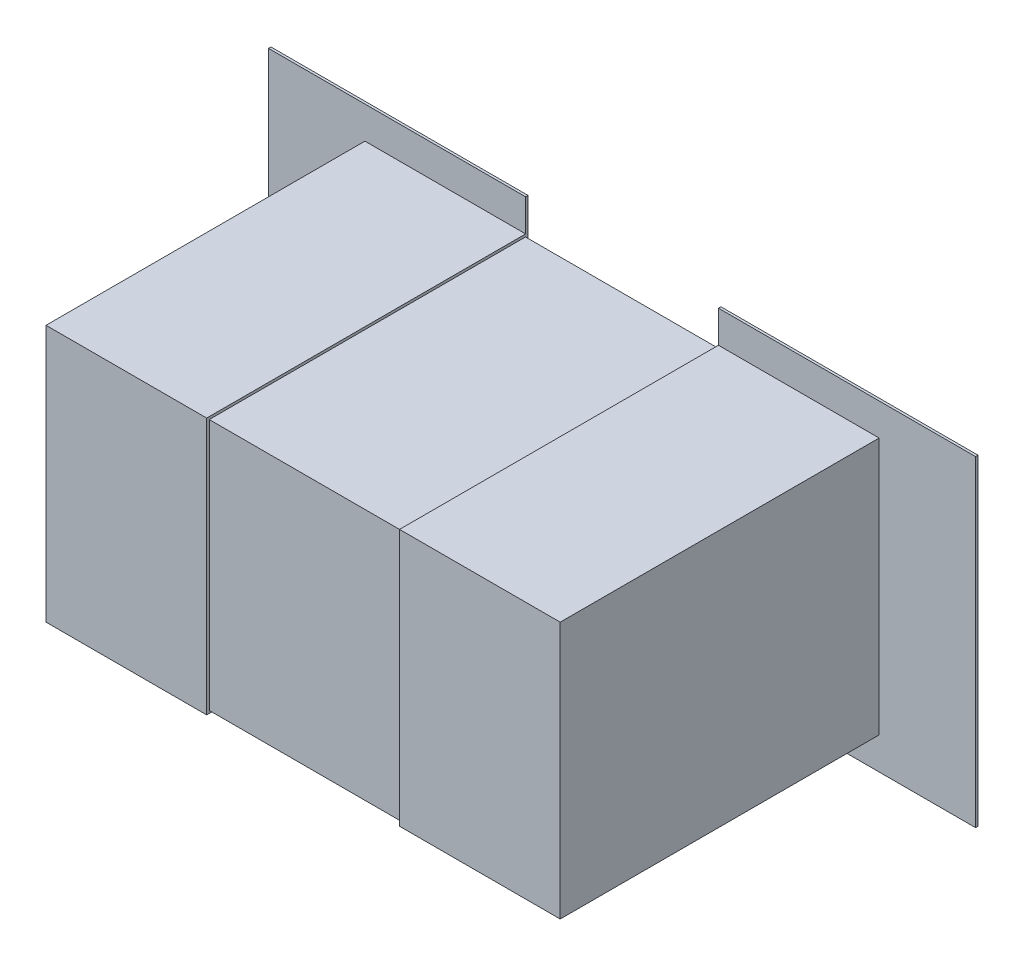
ISO-10303-21;
HEADER;
FILE_DESCRIPTION(('STEP AP214'),'2;1');
FILE_NAME('part.step','',(''),(''),'','','');
FILE_SCHEMA(('AUTOMOTIVE_DESIGN { 1 0 10303 214 1 1 1 1 }'));
ENDSEC;
DATA;
#1=APPLICATION_CONTEXT('core data for automotive mechanical design processes');
#2=APPLICATION_PROTOCOL_DEFINITION('international standard','automotive_design',2000,#1);
#3=PRODUCT_CONTEXT('',#1,'mechanical');
#4=PRODUCT('Part','Part','',(#3));
#5=PRODUCT_RELATED_PRODUCT_CATEGORY('part','',(#4));
#6=PRODUCT_DEFINITION_FORMATION('','',#4);
#7=PRODUCT_DEFINITION_CONTEXT('part definition',#1,'design');
#8=PRODUCT_DEFINITION('design','',#6,#7);
#9=PRODUCT_DEFINITION_SHAPE('','',#8);
#10=(LENGTH_UNIT() NAMED_UNIT(*) SI_UNIT(.MILLI.,.METRE.));
#11=(NAMED_UNIT(*) PLANE_ANGLE_UNIT() SI_UNIT($,.RADIAN.));
#12=(NAMED_UNIT(*) SI_UNIT($,.STERADIAN.) SOLID_ANGLE_UNIT());
#13=UNCERTAINTY_MEASURE_WITH_UNIT(LENGTH_MEASURE(1.E-05),#10,'distance_accuracy_value','');
#14=(GEOMETRIC_REPRESENTATION_CONTEXT(3) GLOBAL_UNCERTAINTY_ASSIGNED_CONTEXT((#13)) GLOBAL_UNIT_ASSIGNED_CONTEXT((#10,
#11,#12)) REPRESENTATION_CONTEXT('',''));
#15=CARTESIAN_POINT('',(0.,0.,0.));
#16=DIRECTION('',(0.,0.,1.));
#17=DIRECTION('',(1.,0.,0.));
#18=AXIS2_PLACEMENT_3D('',#15,#16,#17);
#19=CARTESIAN_POINT('',(0.800000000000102,-0.399999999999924,0.0762));
#20=DIRECTION('',(1.,0.,0.));
#21=DIRECTION('',(0.,0.,-1.));
#22=AXIS2_PLACEMENT_3D('',#19,#20,#21);
#23=PLANE('',#22);
#24=DIRECTION('',(0.,0.,-1.));
#25=VECTOR('',#24,1.);
#26=CARTESIAN_POINT('',(0.800000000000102,-0.399999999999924,0.0762));
#27=LINE('',#26,#25);
#28=CARTESIAN_POINT('',(0.800000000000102,-0.399999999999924,0.08382));
#29=VERTEX_POINT('',#28);
#30=CARTESIAN_POINT('',(0.800000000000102,-0.399999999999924,1.076198));
#31=VERTEX_POINT('',#30);
#32=EDGE_CURVE('E181',#29,#31,#27,.F.);
#33=ORIENTED_EDGE('',*,*,#32,.F.);
#34=DIRECTION('',(0.,1.,0.));
#35=VECTOR('',#34,1.);
#36=CARTESIAN_POINT('',(0.800000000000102,0.,0.08382));
#37=LINE('',#36,#35);
#38=CARTESIAN_POINT('',(0.800000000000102,0.399999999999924,0.08382));
#39=VERTEX_POINT('',#38);
#40=EDGE_CURVE('E191',#39,#29,#37,.F.);
#41=ORIENTED_EDGE('',*,*,#40,.F.);
#42=DIRECTION('',(0.,0.,1.));
#43=VECTOR('',#42,1.);
#44=CARTESIAN_POINT('',(0.800000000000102,0.399999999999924,0.0762));
#45=LINE('',#44,#43);
#46=CARTESIAN_POINT('',(0.800000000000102,0.399999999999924,1.076198));
#47=VERTEX_POINT('',#46);
#48=EDGE_CURVE('E174',#47,#39,#45,.F.);
#49=ORIENTED_EDGE('',*,*,#48,.F.);
#50=DIRECTION('',(0.,1.,0.));
#51=VECTOR('',#50,1.);
#52=CARTESIAN_POINT('',(0.800000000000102,0.,1.076198));
#53=LINE('',#52,#51);
#54=EDGE_CURVE('E149',#31,#47,#53,.T.);
#55=ORIENTED_EDGE('',*,*,#54,.F.);
#56=EDGE_LOOP('',(#33,#41,#49,#55));
#57=FACE_BOUND('',#56,.T.);
#58=ADVANCED_FACE('F16',(#57),#23,.T.);
#59=CARTESIAN_POINT('',(1.09999999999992,-0.500000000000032,0.0762));
#60=DIRECTION('',(1.,0.,0.));
#61=DIRECTION('',(0.,0.,-1.));
#62=AXIS2_PLACEMENT_3D('',#59,#60,#61);
#63=PLANE('',#62);
#64=DIRECTION('',(0.,0.,-1.));
#65=VECTOR('',#64,1.);
#66=CARTESIAN_POINT('',(1.09999999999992,-0.500000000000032,0.0762));
#67=LINE('',#66,#65);
#68=CARTESIAN_POINT('',(1.09999999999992,-0.500000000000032,0.0762));
#69=VERTEX_POINT('',#68);
#70=CARTESIAN_POINT('',(1.09999999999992,-0.500000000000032,0.08382));
#71=VERTEX_POINT('',#70);
#72=EDGE_CURVE('E167',#69,#71,#67,.F.);
#73=ORIENTED_EDGE('',*,*,#72,.F.);
#74=DIRECTION('',(0.,1.,0.));
#75=VECTOR('',#74,1.);
#76=CARTESIAN_POINT('',(1.09999999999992,0.,0.0762));
#77=LINE('',#76,#75);
#78=CARTESIAN_POINT('',(1.09999999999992,0.500000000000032,0.0762));
#79=VERTEX_POINT('',#78);
#80=EDGE_CURVE('E19',#69,#79,#77,.T.);
#81=ORIENTED_EDGE('',*,*,#80,.T.);
#82=DIRECTION('',(0.,0.,1.));
#83=VECTOR('',#82,1.);
#84=CARTESIAN_POINT('',(1.09999999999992,0.500000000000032,0.0762));
#85=LINE('',#84,#83);
#86=CARTESIAN_POINT('',(1.09999999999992,0.500000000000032,0.08382));
#87=VERTEX_POINT('',#86);
#88=EDGE_CURVE('E155',#87,#79,#85,.F.);
#89=ORIENTED_EDGE('',*,*,#88,.F.);
#90=DIRECTION('',(0.,1.,0.));
#91=VECTOR('',#90,1.);
#92=CARTESIAN_POINT('',(1.09999999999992,0.,0.08382));
#93=LINE('',#92,#91);
#94=EDGE_CURVE('E185',#71,#87,#93,.T.);
#95=ORIENTED_EDGE('',*,*,#94,.F.);
#96=EDGE_LOOP('',(#73,#81,#89,#95));
#97=FACE_BOUND('',#96,.T.);
#98=ADVANCED_FACE('F166',(#97),#63,.T.);
#99=CARTESIAN_POINT('',(0.,0.,0.0762));
#100=DIRECTION('',(0.,0.,1.));
#101=DIRECTION('',(1.,0.,0.));
#102=AXIS2_PLACEMENT_3D('',#99,#100,#101);
#103=PLANE('',#102);
#104=ORIENTED_EDGE('',*,*,#80,.F.);
#105=DIRECTION('',(1.,0.,0.));
#106=VECTOR('',#105,1.);
#107=CARTESIAN_POINT('',(0.30000000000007,-0.500000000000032,0.0762));
#108=LINE('',#107,#106);
#109=CARTESIAN_POINT('',(0.30000000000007,-0.500000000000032,0.0762));
#110=VERTEX_POINT('',#109);
#111=EDGE_CURVE('E198',#110,#69,#108,.T.);
#112=ORIENTED_EDGE('',*,*,#111,.F.);
#113=DIRECTION('',(0.,1.,0.));
#114=VECTOR('',#113,1.);
#115=CARTESIAN_POINT('',(0.30000000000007,-0.399999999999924,0.0762));
#116=LINE('',#115,#114);
#117=CARTESIAN_POINT('',(0.30000000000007,0.500000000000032,0.0762));
#118=VERTEX_POINT('',#117);
#119=EDGE_CURVE('E173',#110,#118,#116,.T.);
#120=ORIENTED_EDGE('',*,*,#119,.T.);
#121=DIRECTION('',(1.,0.,0.));
#122=VECTOR('',#121,1.);
#123=CARTESIAN_POINT('',(1.09999999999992,0.500000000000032,0.0762));
#124=LINE('',#123,#122);
#125=EDGE_CURVE('E160',#79,#118,#124,.F.);
#126=ORIENTED_EDGE('',*,*,#125,.F.);
#127=EDGE_LOOP('',(#104,#112,#120,#126));
#128=FACE_BOUND('',#127,.T.);
#129=ADVANCED_FACE('F172',(#128),#103,.F.);
#130=CARTESIAN_POINT('',(1.09999999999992,0.500000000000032,0.0762));
#131=DIRECTION('',(0.,1.,0.));
#132=DIRECTION('',(0.,0.,1.));
#133=AXIS2_PLACEMENT_3D('',#130,#131,#132);
#134=PLANE('',#133);
#135=ORIENTED_EDGE('',*,*,#88,.T.);
#136=ORIENTED_EDGE('',*,*,#125,.T.);
#137=DIRECTION('',(0.,0.,-1.));
#138=VECTOR('',#137,1.);
#139=CARTESIAN_POINT('',(0.30000000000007,0.500000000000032,0.0841999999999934));
#140=LINE('',#139,#138);
#141=CARTESIAN_POINT('',(0.30000000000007,0.500000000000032,0.08382));
#142=VERTEX_POINT('',#141);
#143=EDGE_CURVE('E201',#118,#142,#140,.F.);
#144=ORIENTED_EDGE('',*,*,#143,.T.);
#145=DIRECTION('',(1.,0.,0.));
#146=VECTOR('',#145,1.);
#147=CARTESIAN_POINT('',(0.,0.500000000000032,0.08382));
#148=LINE('',#147,#146);
#149=EDGE_CURVE('E162',#87,#142,#148,.F.);
#150=ORIENTED_EDGE('',*,*,#149,.F.);
#151=EDGE_LOOP('',(#135,#136,#144,#150));
#152=FACE_BOUND('',#151,.T.);
#153=ADVANCED_FACE('F157',(#152),#134,.T.);
#154=CARTESIAN_POINT('',(0.800000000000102,0.399999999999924,0.0762));
#155=DIRECTION('',(0.,1.,0.));
#156=DIRECTION('',(0.,0.,1.));
#157=AXIS2_PLACEMENT_3D('',#154,#155,#156);
#158=PLANE('',#157);
#159=ORIENTED_EDGE('',*,*,#48,.T.);
#160=DIRECTION('',(1.,0.,0.));
#161=VECTOR('',#160,1.);
#162=CARTESIAN_POINT('',(0.,0.399999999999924,0.08382));
#163=LINE('',#162,#161);
#164=CARTESIAN_POINT('',(0.30000000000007,0.399999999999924,0.08382));
#165=VERTEX_POINT('',#164);
#166=EDGE_CURVE('E188',#165,#39,#163,.T.);
#167=ORIENTED_EDGE('',*,*,#166,.F.);
#168=DIRECTION('',(0.,0.,-1.));
#169=VECTOR('',#168,1.);
#170=CARTESIAN_POINT('',(0.30000000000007,0.399999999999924,0.0841999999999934));
#171=LINE('',#170,#169);
#172=CARTESIAN_POINT('',(0.30000000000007,0.399999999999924,1.076198));
#173=VERTEX_POINT('',#172);
#174=EDGE_CURVE('E206',#165,#173,#171,.F.);
#175=ORIENTED_EDGE('',*,*,#174,.T.);
#176=DIRECTION('',(1.,0.,0.));
#177=VECTOR('',#176,1.);
#178=CARTESIAN_POINT('',(0.,0.399999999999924,1.076198));
#179=LINE('',#178,#177);
#180=EDGE_CURVE('E179',#47,#173,#179,.F.);
#181=ORIENTED_EDGE('',*,*,#180,.F.);
#182=EDGE_LOOP('',(#159,#167,#175,#181));
#183=FACE_BOUND('',#182,.T.);
#184=ADVANCED_FACE('F397',(#183),#158,.T.);
#185=CARTESIAN_POINT('',(0.,0.,1.076198));
#186=DIRECTION('',(0.,0.,1.));
#187=DIRECTION('',(1.,0.,0.));
#188=AXIS2_PLACEMENT_3D('',#185,#186,#187);
#189=PLANE('',#188);
#190=ORIENTED_EDGE('',*,*,#180,.T.);
#191=DIRECTION('',(0.,1.,0.));
#192=VECTOR('',#191,1.);
#193=CARTESIAN_POINT('',(0.30000000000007,-0.399999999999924,1.076198));
#194=LINE('',#193,#192);
#195=CARTESIAN_POINT('',(0.30000000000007,-0.399999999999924,1.076198));
#196=VERTEX_POINT('',#195);
#197=EDGE_CURVE('E209',#173,#196,#194,.F.);
#198=ORIENTED_EDGE('',*,*,#197,.T.);
#199=DIRECTION('',(1.,0.,0.));
#200=VECTOR('',#199,1.);
#201=CARTESIAN_POINT('',(-0.800000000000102,-0.399999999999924,1.076198));
#202=LINE('',#201,#200);
#203=EDGE_CURVE('E183',#31,#196,#202,.F.);
#204=ORIENTED_EDGE('',*,*,#203,.F.);
#205=ORIENTED_EDGE('',*,*,#54,.T.);
#206=EDGE_LOOP('',(#190,#198,#204,#205));
#207=FACE_BOUND('',#206,.T.);
#208=ADVANCED_FACE('F393',(#207),#189,.T.);
#209=CARTESIAN_POINT('',(-0.800000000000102,-0.399999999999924,0.0762));
#210=DIRECTION('',(0.,-1.,0.));
#211=DIRECTION('',(0.,0.,-1.));
#212=AXIS2_PLACEMENT_3D('',#209,#210,#211);
#213=PLANE('',#212);
#214=DIRECTION('',(0.,0.,-1.));
#215=VECTOR('',#214,1.);
#216=CARTESIAN_POINT('',(0.30000000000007,-0.399999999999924,0.0841999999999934));
#217=LINE('',#216,#215);
#218=CARTESIAN_POINT('',(0.30000000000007,-0.399999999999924,0.08382));
#219=VERTEX_POINT('',#218);
#220=EDGE_CURVE('E212',#196,#219,#217,.T.);
#221=ORIENTED_EDGE('',*,*,#220,.T.);
#222=DIRECTION('',(1.,0.,0.));
#223=VECTOR('',#222,1.);
#224=CARTESIAN_POINT('',(0.,-0.399999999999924,0.08382));
#225=LINE('',#224,#223);
#226=EDGE_CURVE('E193',#29,#219,#225,.F.);
#227=ORIENTED_EDGE('',*,*,#226,.F.);
#228=ORIENTED_EDGE('',*,*,#32,.T.);
#229=ORIENTED_EDGE('',*,*,#203,.T.);
#230=EDGE_LOOP('',(#221,#227,#228,#229));
#231=FACE_BOUND('',#230,.T.);
#232=ADVANCED_FACE('F389',(#231),#213,.T.);
#233=CARTESIAN_POINT('',(0.,0.,0.08382));
#234=DIRECTION('',(0.,0.,1.));
#235=DIRECTION('',(1.,0.,0.));
#236=AXIS2_PLACEMENT_3D('',#233,#234,#235);
#237=PLANE('',#236);
#238=ORIENTED_EDGE('',*,*,#40,.T.);
#239=ORIENTED_EDGE('',*,*,#226,.T.);
#240=DIRECTION('',(0.,1.,0.));
#241=VECTOR('',#240,1.);
#242=CARTESIAN_POINT('',(0.30000000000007,-0.399999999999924,0.08382));
#243=LINE('',#242,#241);
#244=CARTESIAN_POINT('',(0.30000000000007,-0.500000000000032,0.08382));
#245=VERTEX_POINT('',#244);
#246=EDGE_CURVE('E215',#219,#245,#243,.F.);
#247=ORIENTED_EDGE('',*,*,#246,.T.);
#248=DIRECTION('',(1.,0.,0.));
#249=VECTOR('',#248,1.);
#250=CARTESIAN_POINT('',(0.30000000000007,-0.500000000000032,0.08382));
#251=LINE('',#250,#249);
#252=EDGE_CURVE('E196',#71,#245,#251,.F.);
#253=ORIENTED_EDGE('',*,*,#252,.F.);
#254=ORIENTED_EDGE('',*,*,#94,.T.);
#255=ORIENTED_EDGE('',*,*,#149,.T.);
#256=DIRECTION('',(0.,1.,0.));
#257=VECTOR('',#256,1.);
#258=CARTESIAN_POINT('',(0.30000000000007,-0.399999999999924,0.08382));
#259=LINE('',#258,#257);
#260=EDGE_CURVE('E203',#142,#165,#259,.F.);
#261=ORIENTED_EDGE('',*,*,#260,.T.);
#262=ORIENTED_EDGE('',*,*,#166,.T.);
#263=EDGE_LOOP('',(#238,#239,#247,#253,#254,#255,#261,#262));
#264=FACE_BOUND('',#263,.T.);
#265=ADVANCED_FACE('F385',(#264),#237,.T.);
#266=CARTESIAN_POINT('',(0.30000000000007,-0.500000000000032,0.0762));
#267=DIRECTION('',(0.,-1.,0.));
#268=DIRECTION('',(0.,0.,-1.));
#269=AXIS2_PLACEMENT_3D('',#266,#267,#268);
#270=PLANE('',#269);
#271=DIRECTION('',(0.,0.,-1.));
#272=VECTOR('',#271,1.);
#273=CARTESIAN_POINT('',(0.30000000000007,-0.500000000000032,0.0841999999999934));
#274=LINE('',#273,#272);
#275=EDGE_CURVE('E218',#245,#110,#274,.T.);
#276=ORIENTED_EDGE('',*,*,#275,.T.);
#277=ORIENTED_EDGE('',*,*,#111,.T.);
#278=ORIENTED_EDGE('',*,*,#72,.T.);
#279=ORIENTED_EDGE('',*,*,#252,.T.);
#280=EDGE_LOOP('',(#276,#277,#278,#279));
#281=FACE_BOUND('',#280,.T.);
#282=ADVANCED_FACE('F381',(#281),#270,.T.);
#283=CARTESIAN_POINT('',(0.30000000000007,-0.399999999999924,0.0841999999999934));
#284=DIRECTION('',(1.,0.,0.));
#285=DIRECTION('',(0.,0.,-1.));
#286=AXIS2_PLACEMENT_3D('',#283,#284,#285);
#287=PLANE('',#286);
#288=DIRECTION('',(0.,1.,0.));
#289=VECTOR('',#288,1.);
#290=CARTESIAN_POINT('',(0.30000000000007,0.399999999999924,1.06819800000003));
#291=LINE('',#290,#289);
#292=CARTESIAN_POINT('',(0.30000000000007,0.391999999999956,1.06819800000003));
#293=VERTEX_POINT('',#292);
#294=CARTESIAN_POINT('',(0.30000000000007,-0.391999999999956,1.06819800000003));
#295=VERTEX_POINT('',#294);
#296=EDGE_CURVE('E247',#293,#295,#291,.F.);
#297=ORIENTED_EDGE('',*,*,#296,.T.);
#298=DIRECTION('',(0.,0.,1.));
#299=VECTOR('',#298,1.);
#300=CARTESIAN_POINT('',(0.30000000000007,-0.391999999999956,1.076198));
#301=LINE('',#300,#299);
#302=CARTESIAN_POINT('',(0.30000000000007,-0.391999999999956,0.0841999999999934));
#303=VERTEX_POINT('',#302);
#304=EDGE_CURVE('E232',#295,#303,#301,.F.);
#305=ORIENTED_EDGE('',*,*,#304,.T.);
#306=DIRECTION('',(0.,1.,0.));
#307=VECTOR('',#306,1.);
#308=CARTESIAN_POINT('',(0.30000000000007,-0.399999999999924,0.0841999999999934));
#309=LINE('',#308,#307);
#310=CARTESIAN_POINT('',(0.30000000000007,0.391999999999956,0.0841999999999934));
#311=VERTEX_POINT('',#310);
#312=EDGE_CURVE('E237',#303,#311,#309,.T.);
#313=ORIENTED_EDGE('',*,*,#312,.T.);
#314=DIRECTION('',(0.,0.,-1.));
#315=VECTOR('',#314,1.);
#316=CARTESIAN_POINT('',(0.30000000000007,0.391999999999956,0.0762));
#317=LINE('',#316,#315);
#318=EDGE_CURVE('E242',#311,#293,#317,.F.);
#319=ORIENTED_EDGE('',*,*,#318,.T.);
#320=EDGE_LOOP('',(#297,#305,#313,#319));
#321=FACE_BOUND('',#320,.T.);
#322=ORIENTED_EDGE('',*,*,#246,.F.);
#323=ORIENTED_EDGE('',*,*,#220,.F.);
#324=ORIENTED_EDGE('',*,*,#197,.F.);
#325=ORIENTED_EDGE('',*,*,#174,.F.);
#326=ORIENTED_EDGE('',*,*,#260,.F.);
#327=ORIENTED_EDGE('',*,*,#143,.F.);
#328=ORIENTED_EDGE('',*,*,#119,.F.);
#329=ORIENTED_EDGE('',*,*,#275,.F.);
#330=EDGE_LOOP('',(#322,#323,#324,#325,#326,#327,#328,#329));
#331=FACE_BOUND('',#330,.T.);
#332=ADVANCED_FACE('F377',(#321,#331),#287,.F.);
#333=CARTESIAN_POINT('',(-0.800000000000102,0.399999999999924,0.0762));
#334=DIRECTION('',(-1.,0.,0.));
#335=DIRECTION('',(0.,0.,1.));
#336=AXIS2_PLACEMENT_3D('',#333,#334,#335);
#337=PLANE('',#336);
#338=DIRECTION('',(0.,0.,1.));
#339=VECTOR('',#338,1.);
#340=CARTESIAN_POINT('',(-0.800000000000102,0.399999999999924,0.0762));
#341=LINE('',#340,#339);
#342=CARTESIAN_POINT('',(-0.800000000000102,0.399999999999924,0.08382));
#343=VERTEX_POINT('',#342);
#344=CARTESIAN_POINT('',(-0.800000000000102,0.399999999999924,1.076198));
#345=VERTEX_POINT('',#344);
#346=EDGE_CURVE('E221',#343,#345,#341,.T.);
#347=ORIENTED_EDGE('',*,*,#346,.F.);
#348=DIRECTION('',(0.,1.,0.));
#349=VECTOR('',#348,1.);
#350=CARTESIAN_POINT('',(-0.800000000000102,0.,0.08382));
#351=LINE('',#350,#349);
#352=CARTESIAN_POINT('',(-0.800000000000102,-0.399999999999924,0.08382));
#353=VERTEX_POINT('',#352);
#354=EDGE_CURVE('E258',#353,#343,#351,.T.);
#355=ORIENTED_EDGE('',*,*,#354,.F.);
#356=DIRECTION('',(0.,0.,-1.));
#357=VECTOR('',#356,1.);
#358=CARTESIAN_POINT('',(-0.800000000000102,-0.399999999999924,0.0762));
#359=LINE('',#358,#357);
#360=CARTESIAN_POINT('',(-0.800000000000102,-0.399999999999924,1.076198));
#361=VERTEX_POINT('',#360);
#362=EDGE_CURVE('E223',#361,#353,#359,.T.);
#363=ORIENTED_EDGE('',*,*,#362,.F.);
#364=DIRECTION('',(0.,1.,0.));
#365=VECTOR('',#364,1.);
#366=CARTESIAN_POINT('',(-0.800000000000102,0.,1.076198));
#367=LINE('',#366,#365);
#368=EDGE_CURVE('E228',#345,#361,#367,.F.);
#369=ORIENTED_EDGE('',*,*,#368,.F.);
#370=EDGE_LOOP('',(#347,#355,#363,#369));
#371=FACE_BOUND('',#370,.T.);
#372=ADVANCED_FACE('F373',(#371),#337,.T.);
#373=CARTESIAN_POINT('',(0.800000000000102,0.399999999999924,0.0762));
#374=DIRECTION('',(0.,1.,0.));
#375=DIRECTION('',(0.,0.,1.));
#376=AXIS2_PLACEMENT_3D('',#373,#374,#375);
#377=PLANE('',#376);
#378=DIRECTION('',(0.,0.,1.));
#379=VECTOR('',#378,1.);
#380=CARTESIAN_POINT('',(-0.30000000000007,0.399999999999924,0.0762));
#381=LINE('',#380,#379);
#382=CARTESIAN_POINT('',(-0.30000000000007,0.399999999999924,1.076198));
#383=VERTEX_POINT('',#382);
#384=CARTESIAN_POINT('',(-0.30000000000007,0.399999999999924,0.08382));
#385=VERTEX_POINT('',#384);
#386=EDGE_CURVE('E261',#383,#385,#381,.F.);
#387=ORIENTED_EDGE('',*,*,#386,.T.);
#388=DIRECTION('',(1.,0.,0.));
#389=VECTOR('',#388,1.);
#390=CARTESIAN_POINT('',(0.,0.399999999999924,0.08382));
#391=LINE('',#390,#389);
#392=EDGE_CURVE('E253',#343,#385,#391,.T.);
#393=ORIENTED_EDGE('',*,*,#392,.F.);
#394=ORIENTED_EDGE('',*,*,#346,.T.);
#395=DIRECTION('',(1.,0.,0.));
#396=VECTOR('',#395,1.);
#397=CARTESIAN_POINT('',(0.,0.399999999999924,1.076198));
#398=LINE('',#397,#396);
#399=EDGE_CURVE('E225',#383,#345,#398,.F.);
#400=ORIENTED_EDGE('',*,*,#399,.F.);
#401=EDGE_LOOP('',(#387,#393,#394,#400));
#402=FACE_BOUND('',#401,.T.);
#403=ADVANCED_FACE('F369',(#402),#377,.T.);
#404=CARTESIAN_POINT('',(-0.800000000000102,-0.399999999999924,0.0762));
#405=DIRECTION('',(0.,-1.,0.));
#406=DIRECTION('',(0.,0.,-1.));
#407=AXIS2_PLACEMENT_3D('',#404,#405,#406);
#408=PLANE('',#407);
#409=ORIENTED_EDGE('',*,*,#362,.T.);
#410=DIRECTION('',(1.,0.,0.));
#411=VECTOR('',#410,1.);
#412=CARTESIAN_POINT('',(0.,-0.399999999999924,0.08382));
#413=LINE('',#412,#411);
#414=CARTESIAN_POINT('',(-0.30000000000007,-0.399999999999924,0.08382));
#415=VERTEX_POINT('',#414);
#416=EDGE_CURVE('E255',#415,#353,#413,.F.);
#417=ORIENTED_EDGE('',*,*,#416,.F.);
#418=DIRECTION('',(0.,0.,1.));
#419=VECTOR('',#418,1.);
#420=CARTESIAN_POINT('',(-0.30000000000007,-0.399999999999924,0.0762));
#421=LINE('',#420,#419);
#422=CARTESIAN_POINT('',(-0.30000000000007,-0.399999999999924,1.076198));
#423=VERTEX_POINT('',#422);
#424=EDGE_CURVE('E270',#415,#423,#421,.T.);
#425=ORIENTED_EDGE('',*,*,#424,.T.);
#426=DIRECTION('',(1.,0.,0.));
#427=VECTOR('',#426,1.);
#428=CARTESIAN_POINT('',(0.,-0.399999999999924,1.076198));
#429=LINE('',#428,#427);
#430=EDGE_CURVE('E230',#361,#423,#429,.T.);
#431=ORIENTED_EDGE('',*,*,#430,.F.);
#432=EDGE_LOOP('',(#409,#417,#425,#431));
#433=FACE_BOUND('',#432,.T.);
#434=ADVANCED_FACE('F365',(#433),#408,.T.);
#435=CARTESIAN_POINT('',(0.,0.,1.076198));
#436=DIRECTION('',(0.,0.,1.));
#437=DIRECTION('',(1.,0.,0.));
#438=AXIS2_PLACEMENT_3D('',#435,#436,#437);
#439=PLANE('',#438);
#440=ORIENTED_EDGE('',*,*,#430,.T.);
#441=DIRECTION('',(0.,1.,0.));
#442=VECTOR('',#441,1.);
#443=CARTESIAN_POINT('',(-0.30000000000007,-0.399999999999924,1.076198));
#444=LINE('',#443,#442);
#445=EDGE_CURVE('E273',#423,#383,#444,.T.);
#446=ORIENTED_EDGE('',*,*,#445,.T.);
#447=ORIENTED_EDGE('',*,*,#399,.T.);
#448=ORIENTED_EDGE('',*,*,#368,.T.);
#449=EDGE_LOOP('',(#440,#446,#447,#448));
#450=FACE_BOUND('',#449,.T.);
#451=ADVANCED_FACE('F361',(#450),#439,.T.);
#452=CARTESIAN_POINT('',(-0.30000000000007,-0.391999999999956,1.076198));
#453=DIRECTION('',(0.,1.,0.));
#454=DIRECTION('',(0.,0.,1.));
#455=AXIS2_PLACEMENT_3D('',#452,#453,#454);
#456=PLANE('',#455);
#457=DIRECTION('',(1.,0.,0.));
#458=VECTOR('',#457,1.);
#459=CARTESIAN_POINT('',(-0.30000000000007,-0.391999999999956,0.0841999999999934));
#460=LINE('',#459,#458);
#461=CARTESIAN_POINT('',(-0.30000000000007,-0.391999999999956,0.0841999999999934));
#462=VERTEX_POINT('',#461);
#463=EDGE_CURVE('E234',#462,#303,#460,.T.);
#464=ORIENTED_EDGE('',*,*,#463,.T.);
#465=ORIENTED_EDGE('',*,*,#304,.F.);
#466=DIRECTION('',(-1.,0.,0.));
#467=VECTOR('',#466,1.);
#468=CARTESIAN_POINT('',(-0.30000000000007,-0.391999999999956,1.06819800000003));
#469=LINE('',#468,#467);
#470=CARTESIAN_POINT('',(-0.30000000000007,-0.391999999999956,1.06819800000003));
#471=VERTEX_POINT('',#470);
#472=EDGE_CURVE('E250',#295,#471,#469,.T.);
#473=ORIENTED_EDGE('',*,*,#472,.T.);
#474=DIRECTION('',(0.,0.,1.));
#475=VECTOR('',#474,1.);
#476=CARTESIAN_POINT('',(-0.30000000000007,-0.391999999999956,0.0762));
#477=LINE('',#476,#475);
#478=EDGE_CURVE('E276',#471,#462,#477,.F.);
#479=ORIENTED_EDGE('',*,*,#478,.T.);
#480=EDGE_LOOP('',(#464,#465,#473,#479));
#481=FACE_BOUND('',#480,.T.);
#482=ADVANCED_FACE('F357',(#481),#456,.F.);
#483=CARTESIAN_POINT('',(-0.30000000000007,-0.399999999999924,0.0841999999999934));
#484=DIRECTION('',(0.,0.,1.));
#485=DIRECTION('',(1.,0.,0.));
#486=AXIS2_PLACEMENT_3D('',#483,#484,#485);
#487=PLANE('',#486);
#488=DIRECTION('',(1.,0.,0.));
#489=VECTOR('',#488,1.);
#490=CARTESIAN_POINT('',(-0.30000000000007,0.391999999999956,0.0841999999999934));
#491=LINE('',#490,#489);
#492=CARTESIAN_POINT('',(-0.30000000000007,0.391999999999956,0.0841999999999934));
#493=VERTEX_POINT('',#492);
#494=EDGE_CURVE('E239',#493,#311,#491,.T.);
#495=ORIENTED_EDGE('',*,*,#494,.T.);
#496=ORIENTED_EDGE('',*,*,#312,.F.);
#497=ORIENTED_EDGE('',*,*,#463,.F.);
#498=DIRECTION('',(0.,1.,0.));
#499=VECTOR('',#498,1.);
#500=CARTESIAN_POINT('',(-0.30000000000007,-0.399999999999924,0.0841999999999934));
#501=LINE('',#500,#499);
#502=EDGE_CURVE('E279',#462,#493,#501,.T.);
#503=ORIENTED_EDGE('',*,*,#502,.T.);
#504=EDGE_LOOP('',(#495,#496,#497,#503));
#505=FACE_BOUND('',#504,.T.);
#506=ADVANCED_FACE('F353',(#505),#487,.F.);
#507=CARTESIAN_POINT('',(-0.30000000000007,0.391999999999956,0.0762));
#508=DIRECTION('',(0.,-1.,0.));
#509=DIRECTION('',(0.,0.,-1.));
#510=AXIS2_PLACEMENT_3D('',#507,#508,#509);
#511=PLANE('',#510);
#512=DIRECTION('',(-1.,0.,0.));
#513=VECTOR('',#512,1.);
#514=CARTESIAN_POINT('',(-0.30000000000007,0.391999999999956,1.06819800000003));
#515=LINE('',#514,#513);
#516=CARTESIAN_POINT('',(-0.30000000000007,0.391999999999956,1.06819800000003));
#517=VERTEX_POINT('',#516);
#518=EDGE_CURVE('E244',#517,#293,#515,.F.);
#519=ORIENTED_EDGE('',*,*,#518,.T.);
#520=ORIENTED_EDGE('',*,*,#318,.F.);
#521=ORIENTED_EDGE('',*,*,#494,.F.);
#522=DIRECTION('',(0.,0.,1.));
#523=VECTOR('',#522,1.);
#524=CARTESIAN_POINT('',(-0.30000000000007,0.391999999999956,0.0762));
#525=LINE('',#524,#523);
#526=EDGE_CURVE('E282',#493,#517,#525,.T.);
#527=ORIENTED_EDGE('',*,*,#526,.T.);
#528=EDGE_LOOP('',(#519,#520,#521,#527));
#529=FACE_BOUND('',#528,.T.);
#530=ADVANCED_FACE('F349',(#529),#511,.F.);
#531=CARTESIAN_POINT('',(-0.30000000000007,0.399999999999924,1.06819800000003));
#532=DIRECTION('',(0.,0.,-1.));
#533=DIRECTION('',(-1.,0.,0.));
#534=AXIS2_PLACEMENT_3D('',#531,#532,#533);
#535=PLANE('',#534);
#536=ORIENTED_EDGE('',*,*,#472,.F.);
#537=ORIENTED_EDGE('',*,*,#296,.F.);
#538=ORIENTED_EDGE('',*,*,#518,.F.);
#539=DIRECTION('',(0.,1.,0.));
#540=VECTOR('',#539,1.);
#541=CARTESIAN_POINT('',(-0.30000000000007,-0.399999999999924,1.06819800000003));
#542=LINE('',#541,#540);
#543=EDGE_CURVE('E285',#517,#471,#542,.F.);
#544=ORIENTED_EDGE('',*,*,#543,.T.);
#545=EDGE_LOOP('',(#536,#537,#538,#544));
#546=FACE_BOUND('',#545,.T.);
#547=ADVANCED_FACE('F345',(#546),#535,.F.);
#548=CARTESIAN_POINT('',(0.,0.,0.08382));
#549=DIRECTION('',(0.,0.,1.));
#550=DIRECTION('',(1.,0.,0.));
#551=AXIS2_PLACEMENT_3D('',#548,#549,#550);
#552=PLANE('',#551);
#553=ORIENTED_EDGE('',*,*,#416,.T.);
#554=ORIENTED_EDGE('',*,*,#354,.T.);
#555=ORIENTED_EDGE('',*,*,#392,.T.);
#556=DIRECTION('',(0.,1.,0.));
#557=VECTOR('',#556,1.);
#558=CARTESIAN_POINT('',(-0.30000000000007,-0.399999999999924,0.08382));
#559=LINE('',#558,#557);
#560=CARTESIAN_POINT('',(-0.30000000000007,0.500000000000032,0.08382));
#561=VERTEX_POINT('',#560);
#562=EDGE_CURVE('E264',#385,#561,#559,.T.);
#563=ORIENTED_EDGE('',*,*,#562,.T.);
#564=DIRECTION('',(1.,0.,0.));
#565=VECTOR('',#564,1.);
#566=CARTESIAN_POINT('',(-0.30000000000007,0.500000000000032,0.08382));
#567=LINE('',#566,#565);
#568=CARTESIAN_POINT('',(-1.09999999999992,0.500000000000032,0.08382));
#569=VERTEX_POINT('',#568);
#570=EDGE_CURVE('E288',#569,#561,#567,.T.);
#571=ORIENTED_EDGE('',*,*,#570,.F.);
#572=DIRECTION('',(0.,1.,0.));
#573=VECTOR('',#572,1.);
#574=CARTESIAN_POINT('',(-1.09999999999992,0.500000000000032,0.08382));
#575=LINE('',#574,#573);
#576=CARTESIAN_POINT('',(-1.09999999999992,-0.500000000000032,0.08382));
#577=VERTEX_POINT('',#576);
#578=EDGE_CURVE('E292',#577,#569,#575,.T.);
#579=ORIENTED_EDGE('',*,*,#578,.F.);
#580=DIRECTION('',(1.,0.,0.));
#581=VECTOR('',#580,1.);
#582=CARTESIAN_POINT('',(-1.09999999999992,-0.500000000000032,0.08382));
#583=LINE('',#582,#581);
#584=CARTESIAN_POINT('',(-0.30000000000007,-0.500000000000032,0.08382));
#585=VERTEX_POINT('',#584);
#586=EDGE_CURVE('E299',#585,#577,#583,.F.);
#587=ORIENTED_EDGE('',*,*,#586,.F.);
#588=DIRECTION('',(0.,1.,0.));
#589=VECTOR('',#588,1.);
#590=CARTESIAN_POINT('',(-0.30000000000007,-0.399999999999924,0.08382));
#591=LINE('',#590,#589);
#592=EDGE_CURVE('E267',#585,#415,#591,.T.);
#593=ORIENTED_EDGE('',*,*,#592,.T.);
#594=EDGE_LOOP('',(#553,#554,#555,#563,#571,#579,#587,#593));
#595=FACE_BOUND('',#594,.T.);
#596=ADVANCED_FACE('F341',(#595),#552,.T.);
#597=CARTESIAN_POINT('',(-0.30000000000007,-0.399999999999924,0.0762));
#598=DIRECTION('',(-1.,0.,0.));
#599=DIRECTION('',(0.,0.,1.));
#600=AXIS2_PLACEMENT_3D('',#597,#598,#599);
#601=PLANE('',#600);
#602=ORIENTED_EDGE('',*,*,#526,.F.);
#603=ORIENTED_EDGE('',*,*,#502,.F.);
#604=ORIENTED_EDGE('',*,*,#478,.F.);
#605=ORIENTED_EDGE('',*,*,#543,.F.);
#606=EDGE_LOOP('',(#602,#603,#604,#605));
#607=FACE_BOUND('',#606,.T.);
#608=ORIENTED_EDGE('',*,*,#424,.F.);
#609=ORIENTED_EDGE('',*,*,#592,.F.);
#610=DIRECTION('',(0.,0.,-1.));
#611=VECTOR('',#610,1.);
#612=CARTESIAN_POINT('',(-0.30000000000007,-0.500000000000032,0.0762));
#613=LINE('',#612,#611);
#614=CARTESIAN_POINT('',(-0.30000000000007,-0.500000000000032,0.0762));
#615=VERTEX_POINT('',#614);
#616=EDGE_CURVE('E296',#615,#585,#613,.F.);
#617=ORIENTED_EDGE('',*,*,#616,.F.);
#618=DIRECTION('',(0.,1.,0.));
#619=VECTOR('',#618,1.);
#620=CARTESIAN_POINT('',(-0.30000000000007,0.,0.0762));
#621=LINE('',#620,#619);
#622=CARTESIAN_POINT('',(-0.30000000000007,0.500000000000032,0.0762));
#623=VERTEX_POINT('',#622);
#624=EDGE_CURVE('E302',#615,#623,#621,.T.);
#625=ORIENTED_EDGE('',*,*,#624,.T.);
#626=DIRECTION('',(0.,0.,1.));
#627=VECTOR('',#626,1.);
#628=CARTESIAN_POINT('',(-0.30000000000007,0.500000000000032,0.0762));
#629=LINE('',#628,#627);
#630=EDGE_CURVE('E290',#561,#623,#629,.F.);
#631=ORIENTED_EDGE('',*,*,#630,.F.);
#632=ORIENTED_EDGE('',*,*,#562,.F.);
#633=ORIENTED_EDGE('',*,*,#386,.F.);
#634=ORIENTED_EDGE('',*,*,#445,.F.);
#635=EDGE_LOOP('',(#608,#609,#617,#625,#631,#632,#633,#634));
#636=FACE_BOUND('',#635,.T.);
#637=ADVANCED_FACE('F323',(#607,#636),#601,.F.);
#638=CARTESIAN_POINT('',(-0.30000000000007,0.500000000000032,0.0762));
#639=DIRECTION('',(0.,1.,0.));
#640=DIRECTION('',(0.,0.,1.));
#641=AXIS2_PLACEMENT_3D('',#638,#639,#640);
#642=PLANE('',#641);
#643=ORIENTED_EDGE('',*,*,#630,.T.);
#644=DIRECTION('',(1.,0.,0.));
#645=VECTOR('',#644,1.);
#646=CARTESIAN_POINT('',(0.,0.500000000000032,0.0762));
#647=LINE('',#646,#645);
#648=CARTESIAN_POINT('',(-1.09999999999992,0.500000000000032,0.0762));
#649=VERTEX_POINT('',#648);
#650=EDGE_CURVE('E305',#623,#649,#647,.F.);
#651=ORIENTED_EDGE('',*,*,#650,.T.);
#652=DIRECTION('',(0.,0.,1.));
#653=VECTOR('',#652,1.);
#654=CARTESIAN_POINT('',(-1.09999999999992,0.500000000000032,0.0762));
#655=LINE('',#654,#653);
#656=EDGE_CURVE('E294',#569,#649,#655,.F.);
#657=ORIENTED_EDGE('',*,*,#656,.F.);
#658=ORIENTED_EDGE('',*,*,#570,.T.);
#659=EDGE_LOOP('',(#643,#651,#657,#658));
#660=FACE_BOUND('',#659,.T.);
#661=ADVANCED_FACE('F317',(#660),#642,.T.);
#662=CARTESIAN_POINT('',(-1.09999999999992,0.500000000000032,0.0762));
#663=DIRECTION('',(-1.,0.,0.));
#664=DIRECTION('',(0.,0.,1.));
#665=AXIS2_PLACEMENT_3D('',#662,#663,#664);
#666=PLANE('',#665);
#667=ORIENTED_EDGE('',*,*,#656,.T.);
#668=DIRECTION('',(0.,1.,0.));
#669=VECTOR('',#668,1.);
#670=CARTESIAN_POINT('',(-1.09999999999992,0.,0.0762));
#671=LINE('',#670,#669);
#672=CARTESIAN_POINT('',(-1.09999999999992,-0.500000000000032,0.0762));
#673=VERTEX_POINT('',#672);
#674=EDGE_CURVE('E25',#649,#673,#671,.F.);
#675=ORIENTED_EDGE('',*,*,#674,.T.);
#676=DIRECTION('',(0.,0.,-1.));
#677=VECTOR('',#676,1.);
#678=CARTESIAN_POINT('',(-1.09999999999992,-0.500000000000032,0.0762));
#679=LINE('',#678,#677);
#680=EDGE_CURVE('E33',#577,#673,#679,.T.);
#681=ORIENTED_EDGE('',*,*,#680,.F.);
#682=ORIENTED_EDGE('',*,*,#578,.T.);
#683=EDGE_LOOP('',(#667,#675,#681,#682));
#684=FACE_BOUND('',#683,.T.);
#685=ADVANCED_FACE('F311',(#684),#666,.T.);
#686=CARTESIAN_POINT('',(-1.09999999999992,-0.500000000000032,0.0762));
#687=DIRECTION('',(0.,-1.,0.));
#688=DIRECTION('',(0.,0.,-1.));
#689=AXIS2_PLACEMENT_3D('',#686,#687,#688);
#690=PLANE('',#689);
#691=ORIENTED_EDGE('',*,*,#680,.T.);
#692=DIRECTION('',(1.,0.,0.));
#693=VECTOR('',#692,1.);
#694=CARTESIAN_POINT('',(0.,-0.500000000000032,0.0762));
#695=LINE('',#694,#693);
#696=EDGE_CURVE('E11',#673,#615,#695,.T.);
#697=ORIENTED_EDGE('',*,*,#696,.T.);
#698=ORIENTED_EDGE('',*,*,#616,.T.);
#699=ORIENTED_EDGE('',*,*,#586,.T.);
#700=EDGE_LOOP('',(#691,#697,#698,#699));
#701=FACE_BOUND('',#700,.T.);
#702=ADVANCED_FACE('F326',(#701),#690,.T.);
#703=CARTESIAN_POINT('',(0.,0.,0.0762));
#704=DIRECTION('',(0.,0.,1.));
#705=DIRECTION('',(1.,0.,0.));
#706=AXIS2_PLACEMENT_3D('',#703,#704,#705);
#707=PLANE('',#706);
#708=ORIENTED_EDGE('',*,*,#674,.F.);
#709=ORIENTED_EDGE('',*,*,#650,.F.);
#710=ORIENTED_EDGE('',*,*,#624,.F.);
#711=ORIENTED_EDGE('',*,*,#696,.F.);
#712=EDGE_LOOP('',(#708,#709,#710,#711));
#713=FACE_BOUND('',#712,.T.);
#714=ADVANCED_FACE('F315',(#713),#707,.F.);
#715=CLOSED_SHELL('',(#58,#98,#129,#153,#184,#208,#232,#265,#282,#332,#372,#403,#434,#451,#482,
#506,#530,#547,#596,#637,#661,#685,#702,#714));
#716=MANIFOLD_SOLID_BREP('B1',#715);
#717=ADVANCED_BREP_SHAPE_REPRESENTATION('',(#18,#716),#14);
#718=SHAPE_DEFINITION_REPRESENTATION(#9,#717);
ENDSEC;
END-ISO-10303-21;
